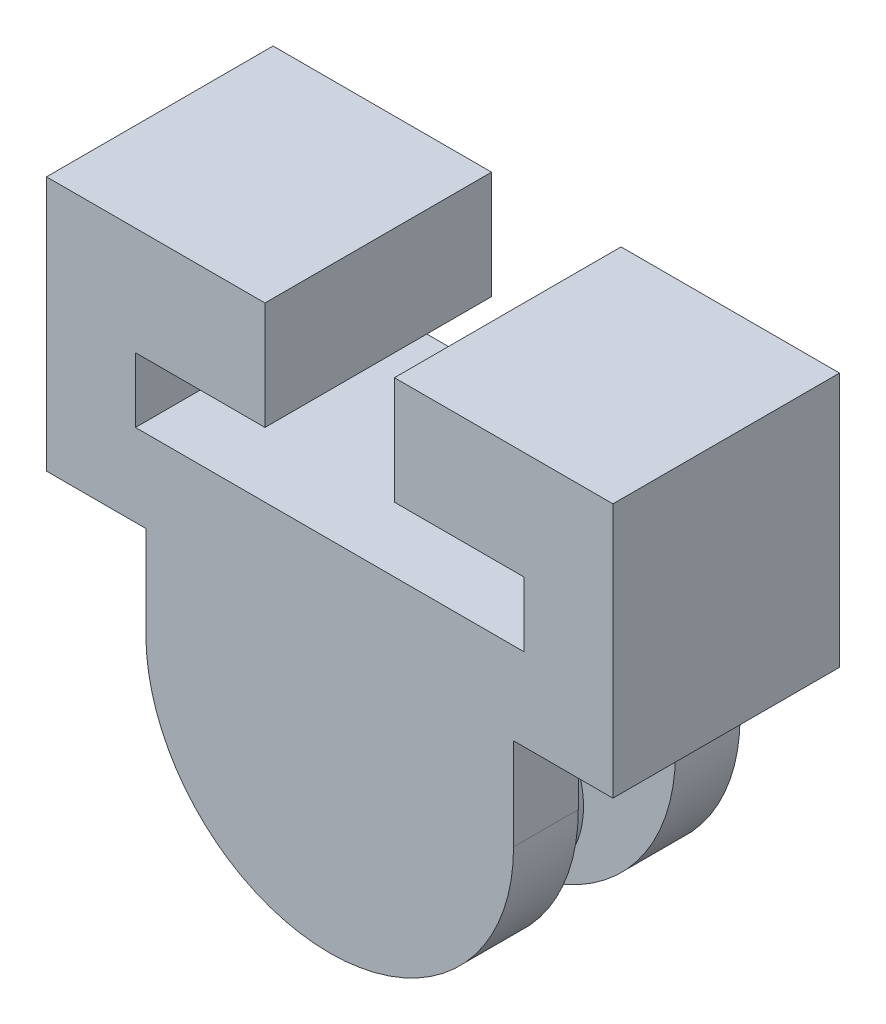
ISO-10303-21;
HEADER;
FILE_DESCRIPTION(('STEP AP214'),'2;1');
FILE_NAME('part.step','',(''),(''),'','','');
FILE_SCHEMA(('AUTOMOTIVE_DESIGN { 1 0 10303 214 1 1 1 1 }'));
ENDSEC;
DATA;
#1=APPLICATION_CONTEXT('core data for automotive mechanical design processes');
#2=APPLICATION_PROTOCOL_DEFINITION('international standard','automotive_design',2000,#1);
#3=PRODUCT_CONTEXT('',#1,'mechanical');
#4=PRODUCT('Part','Part','',(#3));
#5=PRODUCT_RELATED_PRODUCT_CATEGORY('part','',(#4));
#6=PRODUCT_DEFINITION_FORMATION('','',#4);
#7=PRODUCT_DEFINITION_CONTEXT('part definition',#1,'design');
#8=PRODUCT_DEFINITION('design','',#6,#7);
#9=PRODUCT_DEFINITION_SHAPE('','',#8);
#10=(LENGTH_UNIT() NAMED_UNIT(*) SI_UNIT(.MILLI.,.METRE.));
#11=(NAMED_UNIT(*) PLANE_ANGLE_UNIT() SI_UNIT($,.RADIAN.));
#12=(NAMED_UNIT(*) SI_UNIT($,.STERADIAN.) SOLID_ANGLE_UNIT());
#13=UNCERTAINTY_MEASURE_WITH_UNIT(LENGTH_MEASURE(1.E-05),#10,'distance_accuracy_value','');
#14=(GEOMETRIC_REPRESENTATION_CONTEXT(3) GLOBAL_UNCERTAINTY_ASSIGNED_CONTEXT((#13)) GLOBAL_UNIT_ASSIGNED_CONTEXT((#10,
#11,#12)) REPRESENTATION_CONTEXT('',''));
#15=CARTESIAN_POINT('',(0.,0.,0.));
#16=DIRECTION('',(0.,0.,1.));
#17=DIRECTION('',(1.,0.,0.));
#18=AXIS2_PLACEMENT_3D('',#15,#16,#17);
#19=CARTESIAN_POINT('',(-55.5625,70.2515647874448,144.042704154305));
#20=DIRECTION('',(0.,-1.,0.));
#21=DIRECTION('',(0.,0.,-1.));
#22=AXIS2_PLACEMENT_3D('',#19,#20,#21);
#23=PLANE('',#22);
#24=DIRECTION('',(0.,0.,-1.));
#25=VECTOR('',#24,1.);
#26=CARTESIAN_POINT('',(-38.1,70.2515647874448,53.3423344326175));
#27=LINE('',#26,#25);
#28=CARTESIAN_POINT('',(-38.1,70.2515647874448,44.45));
#29=VERTEX_POINT('',#28);
#30=CARTESIAN_POINT('',(-38.1,70.2515647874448,0.));
#31=VERTEX_POINT('',#30);
#32=EDGE_CURVE('E339',#29,#31,#27,.T.);
#33=ORIENTED_EDGE('',*,*,#32,.F.);
#34=DIRECTION('',(-1.,0.,0.));
#35=VECTOR('',#34,1.);
#36=CARTESIAN_POINT('',(38.1,70.2515647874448,44.45));
#37=LINE('',#36,#35);
#38=CARTESIAN_POINT('',(38.1,70.2515647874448,44.45));
#39=VERTEX_POINT('',#38);
#40=EDGE_CURVE('E267',#39,#29,#37,.T.);
#41=ORIENTED_EDGE('',*,*,#40,.F.);
#42=DIRECTION('',(0.,0.,-1.));
#43=VECTOR('',#42,1.);
#44=CARTESIAN_POINT('',(38.1,70.2515647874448,53.3423344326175));
#45=LINE('',#44,#43);
#46=CARTESIAN_POINT('',(38.1,70.2515647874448,0.));
#47=VERTEX_POINT('',#46);
#48=EDGE_CURVE('E334',#39,#47,#45,.T.);
#49=ORIENTED_EDGE('',*,*,#48,.T.);
#50=DIRECTION('',(-1.,0.,0.));
#51=VECTOR('',#50,1.);
#52=CARTESIAN_POINT('',(-55.5625,70.2515647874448,0.));
#53=LINE('',#52,#51);
#54=EDGE_CURVE('E353',#47,#31,#53,.T.);
#55=ORIENTED_EDGE('',*,*,#54,.T.);
#56=EDGE_LOOP('',(#33,#41,#49,#55));
#57=FACE_BOUND('',#56,.T.);
#58=ADVANCED_FACE('F47',(#57),#23,.F.);
#59=CARTESIAN_POINT('',(0.,36.0664038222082,12.7));
#60=DIRECTION('',(0.,0.,-1.));
#61=DIRECTION('',(-1.,0.,0.));
#62=AXIS2_PLACEMENT_3D('',#59,#60,#61);
#63=CYLINDRICAL_SURFACE('',#62,36.0664038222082);
#64=CARTESIAN_POINT('',(0.,36.0664038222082,0.));
#65=DIRECTION('',(0.,0.,1.));
#66=DIRECTION('',(-1.,0.,0.));
#67=AXIS2_PLACEMENT_3D('',#64,#65,#66);
#68=CIRCLE('',#67,36.0664038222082);
#69=CARTESIAN_POINT('',(-36.0664038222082,36.0664038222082,0.));
#70=VERTEX_POINT('',#69);
#71=CARTESIAN_POINT('',(36.0664038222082,36.0664038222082,0.));
#72=VERTEX_POINT('',#71);
#73=EDGE_CURVE('E381',#70,#72,#68,.T.);
#74=ORIENTED_EDGE('',*,*,#73,.T.);
#75=DIRECTION('',(0.,0.,-1.));
#76=VECTOR('',#75,1.);
#77=CARTESIAN_POINT('',(36.0664038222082,36.0664038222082,12.7));
#78=LINE('',#77,#76);
#79=CARTESIAN_POINT('',(36.0664038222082,36.0664038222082,12.7));
#80=VERTEX_POINT('',#79);
#81=EDGE_CURVE('E11',#80,#72,#78,.T.);
#82=ORIENTED_EDGE('',*,*,#81,.F.);
#83=CARTESIAN_POINT('',(0.,36.0664038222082,12.7));
#84=DIRECTION('',(0.,0.,1.));
#85=DIRECTION('',(-1.,0.,0.));
#86=AXIS2_PLACEMENT_3D('',#83,#84,#85);
#87=CIRCLE('',#86,36.0664038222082);
#88=CARTESIAN_POINT('',(0.,0.,12.7));
#89=VERTEX_POINT('',#88);
#90=EDGE_CURVE('E389',#89,#80,#87,.T.);
#91=ORIENTED_EDGE('',*,*,#90,.F.);
#92=CARTESIAN_POINT('',(-36.0664038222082,36.0664038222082,12.7));
#93=VERTEX_POINT('',#92);
#94=EDGE_CURVE('E385',#93,#89,#87,.T.);
#95=ORIENTED_EDGE('',*,*,#94,.F.);
#96=DIRECTION('',(0.,0.,-1.));
#97=VECTOR('',#96,1.);
#98=CARTESIAN_POINT('',(-36.0664038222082,36.0664038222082,12.7));
#99=LINE('',#98,#97);
#100=EDGE_CURVE('E398',#93,#70,#99,.T.);
#101=ORIENTED_EDGE('',*,*,#100,.T.);
#102=EDGE_LOOP('',(#74,#82,#91,#95,#101));
#103=FACE_BOUND('',#102,.T.);
#104=ADVANCED_FACE('F49',(#103),#63,.T.);
#105=CARTESIAN_POINT('',(36.0664038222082,36.0664038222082,12.7));
#106=DIRECTION('',(-1.,0.,0.));
#107=DIRECTION('',(0.,0.,1.));
#108=AXIS2_PLACEMENT_3D('',#105,#106,#107);
#109=PLANE('',#108);
#110=DIRECTION('',(0.,1.,0.));
#111=VECTOR('',#110,1.);
#112=CARTESIAN_POINT('',(36.0664038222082,36.0664038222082,0.));
#113=LINE('',#112,#111);
#114=CARTESIAN_POINT('',(36.0664038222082,54.0996057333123,0.));
#115=VERTEX_POINT('',#114);
#116=EDGE_CURVE('E402',#72,#115,#113,.T.);
#117=ORIENTED_EDGE('',*,*,#116,.T.);
#118=DIRECTION('',(0.,0.,-1.));
#119=VECTOR('',#118,1.);
#120=CARTESIAN_POINT('',(36.0664038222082,54.0996057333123,12.7));
#121=LINE('',#120,#119);
#122=CARTESIAN_POINT('',(36.0664038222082,54.0996057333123,12.7));
#123=VERTEX_POINT('',#122);
#124=EDGE_CURVE('E56',#123,#115,#121,.T.);
#125=ORIENTED_EDGE('',*,*,#124,.F.);
#126=DIRECTION('',(0.,1.,0.));
#127=VECTOR('',#126,1.);
#128=CARTESIAN_POINT('',(36.0664038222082,36.0664038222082,12.7));
#129=LINE('',#128,#127);
#130=EDGE_CURVE('E388',#80,#123,#129,.T.);
#131=ORIENTED_EDGE('',*,*,#130,.F.);
#132=ORIENTED_EDGE('',*,*,#81,.T.);
#133=EDGE_LOOP('',(#117,#125,#131,#132));
#134=FACE_BOUND('',#133,.T.);
#135=ADVANCED_FACE('F436',(#134),#109,.F.);
#136=CARTESIAN_POINT('',(-36.0664038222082,36.0664038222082,12.7));
#137=DIRECTION('',(1.,0.,0.));
#138=DIRECTION('',(0.,0.,-1.));
#139=AXIS2_PLACEMENT_3D('',#136,#137,#138);
#140=PLANE('',#139);
#141=DIRECTION('',(0.,-1.,0.));
#142=VECTOR('',#141,1.);
#143=CARTESIAN_POINT('',(-36.0664038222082,36.0664038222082,0.));
#144=LINE('',#143,#142);
#145=CARTESIAN_POINT('',(-36.0664038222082,54.0996057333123,0.));
#146=VERTEX_POINT('',#145);
#147=EDGE_CURVE('E405',#146,#70,#144,.T.);
#148=ORIENTED_EDGE('',*,*,#147,.T.);
#149=ORIENTED_EDGE('',*,*,#100,.F.);
#150=DIRECTION('',(0.,-1.,0.));
#151=VECTOR('',#150,1.);
#152=CARTESIAN_POINT('',(-36.0664038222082,36.0664038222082,12.7));
#153=LINE('',#152,#151);
#154=CARTESIAN_POINT('',(-36.0664038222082,54.0996057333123,12.7));
#155=VERTEX_POINT('',#154);
#156=EDGE_CURVE('E395',#155,#93,#153,.T.);
#157=ORIENTED_EDGE('',*,*,#156,.F.);
#158=DIRECTION('',(0.,0.,-1.));
#159=VECTOR('',#158,1.);
#160=CARTESIAN_POINT('',(-36.0664038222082,54.0996057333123,12.7));
#161=LINE('',#160,#159);
#162=EDGE_CURVE('E411',#155,#146,#161,.T.);
#163=ORIENTED_EDGE('',*,*,#162,.T.);
#164=EDGE_LOOP('',(#148,#149,#157,#163));
#165=FACE_BOUND('',#164,.T.);
#166=ADVANCED_FACE('F516',(#165),#140,.F.);
#167=CARTESIAN_POINT('',(0.,36.0664038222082,12.7));
#168=DIRECTION('',(0.,0.,-1.));
#169=DIRECTION('',(-1.,0.,0.));
#170=AXIS2_PLACEMENT_3D('',#167,#168,#169);
#171=PLANE('',#170);
#172=ORIENTED_EDGE('',*,*,#94,.T.);
#173=CARTESIAN_POINT('',(0.,18.0332019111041,12.7));
#174=DIRECTION('',(0.,0.,1.));
#175=DIRECTION('',(1.,0.,0.));
#176=AXIS2_PLACEMENT_3D('',#173,#174,#175);
#177=CIRCLE('',#176,18.0332019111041);
#178=EDGE_CURVE('E371',#89,#89,#177,.T.);
#179=ORIENTED_EDGE('',*,*,#178,.F.);
#180=ORIENTED_EDGE('',*,*,#90,.T.);
#181=ORIENTED_EDGE('',*,*,#130,.T.);
#182=DIRECTION('',(-1.,0.,0.));
#183=VECTOR('',#182,1.);
#184=CARTESIAN_POINT('',(-36.0664038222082,54.0996057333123,12.7));
#185=LINE('',#184,#183);
#186=EDGE_CURVE('E392',#123,#155,#185,.T.);
#187=ORIENTED_EDGE('',*,*,#186,.T.);
#188=ORIENTED_EDGE('',*,*,#156,.T.);
#189=EDGE_LOOP('',(#172,#179,#180,#181,#187,#188));
#190=FACE_BOUND('',#189,.T.);
#191=ADVANCED_FACE('F432',(#190),#171,.F.);
#192=CARTESIAN_POINT('',(0.,36.0664038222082,0.));
#193=DIRECTION('',(0.,0.,-1.));
#194=DIRECTION('',(-1.,0.,0.));
#195=AXIS2_PLACEMENT_3D('',#192,#193,#194);
#196=PLANE('',#195);
#197=ORIENTED_EDGE('',*,*,#73,.F.);
#198=ORIENTED_EDGE('',*,*,#147,.F.);
#199=DIRECTION('',(1.,0.,0.));
#200=VECTOR('',#199,1.);
#201=CARTESIAN_POINT('',(-55.5625,54.0996057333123,0.));
#202=LINE('',#201,#200);
#203=CARTESIAN_POINT('',(-55.5625,54.0996057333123,0.));
#204=VERTEX_POINT('',#203);
#205=EDGE_CURVE('E360',#204,#146,#202,.T.);
#206=ORIENTED_EDGE('',*,*,#205,.F.);
#207=DIRECTION('',(0.,-1.,0.));
#208=VECTOR('',#207,1.);
#209=CARTESIAN_POINT('',(-55.5625,54.0996057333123,0.));
#210=LINE('',#209,#208);
#211=CARTESIAN_POINT('',(-55.5625,104.105877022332,0.));
#212=VERTEX_POINT('',#211);
#213=EDGE_CURVE('E343',#212,#204,#210,.T.);
#214=ORIENTED_EDGE('',*,*,#213,.F.);
#215=DIRECTION('',(-1.,0.,0.));
#216=VECTOR('',#215,1.);
#217=CARTESIAN_POINT('',(-55.5625,104.105877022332,0.));
#218=LINE('',#217,#216);
#219=CARTESIAN_POINT('',(-12.7,104.105877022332,0.));
#220=VERTEX_POINT('',#219);
#221=EDGE_CURVE('E204',#220,#212,#218,.T.);
#222=ORIENTED_EDGE('',*,*,#221,.F.);
#223=DIRECTION('',(0.,1.,0.));
#224=VECTOR('',#223,1.);
#225=CARTESIAN_POINT('',(-12.7,82.9515647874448,0.));
#226=LINE('',#225,#224);
#227=CARTESIAN_POINT('',(-12.7,82.9515647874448,0.));
#228=VERTEX_POINT('',#227);
#229=EDGE_CURVE('E199',#228,#220,#226,.T.);
#230=ORIENTED_EDGE('',*,*,#229,.F.);
#231=DIRECTION('',(1.,0.,0.));
#232=VECTOR('',#231,1.);
#233=CARTESIAN_POINT('',(-55.5625,82.9515647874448,0.));
#234=LINE('',#233,#232);
#235=CARTESIAN_POINT('',(-38.1,82.9515647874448,0.));
#236=VERTEX_POINT('',#235);
#237=EDGE_CURVE('E320',#236,#228,#234,.T.);
#238=ORIENTED_EDGE('',*,*,#237,.F.);
#239=DIRECTION('',(0.,1.,0.));
#240=VECTOR('',#239,1.);
#241=CARTESIAN_POINT('',(-38.1,70.2515647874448,0.));
#242=LINE('',#241,#240);
#243=EDGE_CURVE('E346',#31,#236,#242,.T.);
#244=ORIENTED_EDGE('',*,*,#243,.F.);
#245=ORIENTED_EDGE('',*,*,#54,.F.);
#246=DIRECTION('',(0.,-1.,0.));
#247=VECTOR('',#246,1.);
#248=CARTESIAN_POINT('',(38.1,70.2515647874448,0.));
#249=LINE('',#248,#247);
#250=CARTESIAN_POINT('',(38.1,82.9515647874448,0.));
#251=VERTEX_POINT('',#250);
#252=EDGE_CURVE('E331',#251,#47,#249,.T.);
#253=ORIENTED_EDGE('',*,*,#252,.F.);
#254=DIRECTION('',(1.,0.,0.));
#255=VECTOR('',#254,1.);
#256=CARTESIAN_POINT('',(55.5625,82.9515647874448,0.));
#257=LINE('',#256,#255);
#258=CARTESIAN_POINT('',(12.7,82.9515647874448,0.));
#259=VERTEX_POINT('',#258);
#260=EDGE_CURVE('E297',#259,#251,#257,.T.);
#261=ORIENTED_EDGE('',*,*,#260,.F.);
#262=DIRECTION('',(0.,-1.,0.));
#263=VECTOR('',#262,1.);
#264=CARTESIAN_POINT('',(12.7,82.9515647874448,0.));
#265=LINE('',#264,#263);
#266=CARTESIAN_POINT('',(12.7,104.105877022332,0.));
#267=VERTEX_POINT('',#266);
#268=EDGE_CURVE('E302',#267,#259,#265,.T.);
#269=ORIENTED_EDGE('',*,*,#268,.F.);
#270=DIRECTION('',(-1.,0.,0.));
#271=VECTOR('',#270,1.);
#272=CARTESIAN_POINT('',(55.5625,104.105877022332,0.));
#273=LINE('',#272,#271);
#274=CARTESIAN_POINT('',(55.5625,104.105877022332,0.));
#275=VERTEX_POINT('',#274);
#276=EDGE_CURVE('E307',#275,#267,#273,.T.);
#277=ORIENTED_EDGE('',*,*,#276,.F.);
#278=DIRECTION('',(0.,1.,0.));
#279=VECTOR('',#278,1.);
#280=CARTESIAN_POINT('',(55.5625,54.0996057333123,0.));
#281=LINE('',#280,#279);
#282=CARTESIAN_POINT('',(55.5625,54.0996057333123,0.));
#283=VERTEX_POINT('',#282);
#284=EDGE_CURVE('E356',#283,#275,#281,.T.);
#285=ORIENTED_EDGE('',*,*,#284,.F.);
#286=EDGE_CURVE('E364',#115,#283,#202,.T.);
#287=ORIENTED_EDGE('',*,*,#286,.F.);
#288=ORIENTED_EDGE('',*,*,#116,.F.);
#289=EDGE_LOOP('',(#197,#198,#206,#214,#222,#230,#238,#244,#245,#253,#261,#269,#277,#285,#287,#288));
#290=FACE_BOUND('',#289,.T.);
#291=ADVANCED_FACE('F425',(#290),#196,.T.);
#292=CARTESIAN_POINT('',(0.,18.0332019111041,31.75));
#293=DIRECTION('',(0.,0.,-1.));
#294=DIRECTION('',(-1.,0.,0.));
#295=AXIS2_PLACEMENT_3D('',#292,#293,#294);
#296=CYLINDRICAL_SURFACE('',#295,18.0332019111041);
#297=CARTESIAN_POINT('',(0.,18.0332019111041,31.75));
#298=DIRECTION('',(0.,0.,1.));
#299=DIRECTION('',(1.,0.,0.));
#300=AXIS2_PLACEMENT_3D('',#297,#298,#299);
#301=CIRCLE('',#300,18.0332019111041);
#302=CARTESIAN_POINT('',(0.,0.,31.75));
#303=VERTEX_POINT('',#302);
#304=EDGE_CURVE('E377',#303,#303,#301,.T.);
#305=ORIENTED_EDGE('',*,*,#304,.F.);
#306=EDGE_LOOP('',(#305));
#307=FACE_BOUND('',#306,.T.);
#308=ORIENTED_EDGE('',*,*,#178,.T.);
#309=EDGE_LOOP('',(#308));
#310=FACE_BOUND('',#309,.T.);
#311=ADVANCED_FACE('F511',(#307,#310),#296,.T.);
#312=CARTESIAN_POINT('',(-55.5625,54.0996057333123,144.042704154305));
#313=DIRECTION('',(1.,0.,0.));
#314=DIRECTION('',(0.,0.,-1.));
#315=AXIS2_PLACEMENT_3D('',#312,#313,#314);
#316=PLANE('',#315);
#317=DIRECTION('',(0.,0.,-1.));
#318=VECTOR('',#317,1.);
#319=CARTESIAN_POINT('',(-55.5625,54.0996057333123,144.042704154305));
#320=LINE('',#319,#318);
#321=CARTESIAN_POINT('',(-55.5625,54.0996057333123,44.45));
#322=VERTEX_POINT('',#321);
#323=EDGE_CURVE('E368',#322,#204,#320,.T.);
#324=ORIENTED_EDGE('',*,*,#323,.F.);
#325=DIRECTION('',(0.,-1.,0.));
#326=VECTOR('',#325,1.);
#327=CARTESIAN_POINT('',(-55.5625,104.105877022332,44.45));
#328=LINE('',#327,#326);
#329=CARTESIAN_POINT('',(-55.5625,104.105877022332,44.45));
#330=VERTEX_POINT('',#329);
#331=EDGE_CURVE('E215',#330,#322,#328,.T.);
#332=ORIENTED_EDGE('',*,*,#331,.F.);
#333=DIRECTION('',(0.,0.,-1.));
#334=VECTOR('',#333,1.);
#335=CARTESIAN_POINT('',(-55.5625,104.105877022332,79.5485233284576));
#336=LINE('',#335,#334);
#337=EDGE_CURVE('E210',#330,#212,#336,.T.);
#338=ORIENTED_EDGE('',*,*,#337,.T.);
#339=ORIENTED_EDGE('',*,*,#213,.T.);
#340=EDGE_LOOP('',(#324,#332,#338,#339));
#341=FACE_BOUND('',#340,.T.);
#342=ADVANCED_FACE('F443',(#341),#316,.F.);
#343=CARTESIAN_POINT('',(-55.5625,54.0996057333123,144.042704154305));
#344=DIRECTION('',(0.,1.,0.));
#345=DIRECTION('',(0.,0.,1.));
#346=AXIS2_PLACEMENT_3D('',#343,#344,#345);
#347=PLANE('',#346);
#348=ORIENTED_EDGE('',*,*,#162,.F.);
#349=ORIENTED_EDGE('',*,*,#186,.F.);
#350=ORIENTED_EDGE('',*,*,#124,.T.);
#351=ORIENTED_EDGE('',*,*,#286,.T.);
#352=DIRECTION('',(0.,0.,-1.));
#353=VECTOR('',#352,1.);
#354=CARTESIAN_POINT('',(55.5625,54.0996057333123,144.042704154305));
#355=LINE('',#354,#353);
#356=CARTESIAN_POINT('',(55.5625,54.0996057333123,44.45));
#357=VERTEX_POINT('',#356);
#358=EDGE_CURVE('E359',#357,#283,#355,.T.);
#359=ORIENTED_EDGE('',*,*,#358,.F.);
#360=DIRECTION('',(1.,0.,0.));
#361=VECTOR('',#360,1.);
#362=CARTESIAN_POINT('',(36.0664038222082,54.0996057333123,44.45));
#363=LINE('',#362,#361);
#364=CARTESIAN_POINT('',(36.0664038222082,54.0996057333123,44.45));
#365=VERTEX_POINT('',#364);
#366=EDGE_CURVE('E243',#365,#357,#363,.T.);
#367=ORIENTED_EDGE('',*,*,#366,.F.);
#368=DIRECTION('',(0.,0.,-1.));
#369=VECTOR('',#368,1.);
#370=CARTESIAN_POINT('',(36.0664038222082,54.0996057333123,44.45));
#371=LINE('',#370,#369);
#372=CARTESIAN_POINT('',(36.0664038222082,54.0996057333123,31.75));
#373=VERTEX_POINT('',#372);
#374=EDGE_CURVE('E276',#365,#373,#371,.T.);
#375=ORIENTED_EDGE('',*,*,#374,.T.);
#376=DIRECTION('',(1.,0.,0.));
#377=VECTOR('',#376,1.);
#378=CARTESIAN_POINT('',(-55.5625,54.0996057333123,31.75));
#379=LINE('',#378,#377);
#380=CARTESIAN_POINT('',(-36.0664038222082,54.0996057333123,31.75));
#381=VERTEX_POINT('',#380);
#382=EDGE_CURVE('E63',#381,#373,#379,.T.);
#383=ORIENTED_EDGE('',*,*,#382,.F.);
#384=DIRECTION('',(0.,0.,-1.));
#385=VECTOR('',#384,1.);
#386=CARTESIAN_POINT('',(-36.0664038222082,54.0996057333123,44.45));
#387=LINE('',#386,#385);
#388=CARTESIAN_POINT('',(-36.0664038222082,54.0996057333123,44.45));
#389=VERTEX_POINT('',#388);
#390=EDGE_CURVE('E294',#389,#381,#387,.T.);
#391=ORIENTED_EDGE('',*,*,#390,.F.);
#392=DIRECTION('',(1.,0.,0.));
#393=VECTOR('',#392,1.);
#394=CARTESIAN_POINT('',(-55.5625,54.0996057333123,44.45));
#395=LINE('',#394,#393);
#396=EDGE_CURVE('E231',#322,#389,#395,.T.);
#397=ORIENTED_EDGE('',*,*,#396,.F.);
#398=ORIENTED_EDGE('',*,*,#323,.T.);
#399=ORIENTED_EDGE('',*,*,#205,.T.);
#400=EDGE_LOOP('',(#348,#349,#350,#351,#359,#367,#375,#383,#391,#397,#398,#399));
#401=FACE_BOUND('',#400,.T.);
#402=ADVANCED_FACE('F419',(#401),#347,.F.);
#403=CARTESIAN_POINT('',(55.5625,54.0996057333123,144.042704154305));
#404=DIRECTION('',(-1.,0.,0.));
#405=DIRECTION('',(0.,0.,1.));
#406=AXIS2_PLACEMENT_3D('',#403,#404,#405);
#407=PLANE('',#406);
#408=DIRECTION('',(0.,0.,-1.));
#409=VECTOR('',#408,1.);
#410=CARTESIAN_POINT('',(55.5625,104.105877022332,79.5485233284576));
#411=LINE('',#410,#409);
#412=CARTESIAN_POINT('',(55.5625,104.105877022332,44.45));
#413=VERTEX_POINT('',#412);
#414=EDGE_CURVE('E311',#413,#275,#411,.T.);
#415=ORIENTED_EDGE('',*,*,#414,.F.);
#416=DIRECTION('',(0.,1.,0.));
#417=VECTOR('',#416,1.);
#418=CARTESIAN_POINT('',(55.5625,54.0996057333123,44.45));
#419=LINE('',#418,#417);
#420=EDGE_CURVE('E247',#357,#413,#419,.T.);
#421=ORIENTED_EDGE('',*,*,#420,.F.);
#422=ORIENTED_EDGE('',*,*,#358,.T.);
#423=ORIENTED_EDGE('',*,*,#284,.T.);
#424=EDGE_LOOP('',(#415,#421,#422,#423));
#425=FACE_BOUND('',#424,.T.);
#426=ADVANCED_FACE('F460',(#425),#407,.F.);
#427=CARTESIAN_POINT('',(-38.1,70.2515647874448,53.3423344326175));
#428=DIRECTION('',(-1.,0.,0.));
#429=DIRECTION('',(0.,0.,1.));
#430=AXIS2_PLACEMENT_3D('',#427,#428,#429);
#431=PLANE('',#430);
#432=DIRECTION('',(0.,0.,-1.));
#433=VECTOR('',#432,1.);
#434=CARTESIAN_POINT('',(-38.1,82.9515647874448,53.3423344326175));
#435=LINE('',#434,#433);
#436=CARTESIAN_POINT('',(-38.1,82.9515647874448,44.45));
#437=VERTEX_POINT('',#436);
#438=EDGE_CURVE('E300',#437,#236,#435,.T.);
#439=ORIENTED_EDGE('',*,*,#438,.F.);
#440=DIRECTION('',(0.,1.,0.));
#441=VECTOR('',#440,1.);
#442=CARTESIAN_POINT('',(-38.1,70.2515647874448,44.45));
#443=LINE('',#442,#441);
#444=EDGE_CURVE('E271',#29,#437,#443,.T.);
#445=ORIENTED_EDGE('',*,*,#444,.F.);
#446=ORIENTED_EDGE('',*,*,#32,.T.);
#447=ORIENTED_EDGE('',*,*,#243,.T.);
#448=EDGE_LOOP('',(#439,#445,#446,#447));
#449=FACE_BOUND('',#448,.T.);
#450=ADVANCED_FACE('F483',(#449),#431,.F.);
#451=CARTESIAN_POINT('',(38.1,70.2515647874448,53.3423344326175));
#452=DIRECTION('',(1.,0.,0.));
#453=DIRECTION('',(0.,0.,-1.));
#454=AXIS2_PLACEMENT_3D('',#451,#452,#453);
#455=PLANE('',#454);
#456=ORIENTED_EDGE('',*,*,#48,.F.);
#457=DIRECTION('',(0.,-1.,0.));
#458=VECTOR('',#457,1.);
#459=CARTESIAN_POINT('',(38.1,82.9515647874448,44.45));
#460=LINE('',#459,#458);
#461=CARTESIAN_POINT('',(38.1,82.9515647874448,44.45));
#462=VERTEX_POINT('',#461);
#463=EDGE_CURVE('E263',#462,#39,#460,.T.);
#464=ORIENTED_EDGE('',*,*,#463,.F.);
#465=DIRECTION('',(0.,0.,-1.));
#466=VECTOR('',#465,1.);
#467=CARTESIAN_POINT('',(38.1,82.9515647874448,53.3423344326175));
#468=LINE('',#467,#466);
#469=EDGE_CURVE('E335',#462,#251,#468,.T.);
#470=ORIENTED_EDGE('',*,*,#469,.T.);
#471=ORIENTED_EDGE('',*,*,#252,.T.);
#472=EDGE_LOOP('',(#456,#464,#470,#471));
#473=FACE_BOUND('',#472,.T.);
#474=ADVANCED_FACE('F475',(#473),#455,.F.);
#475=CARTESIAN_POINT('',(55.5625,82.9515647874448,79.5485233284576));
#476=DIRECTION('',(0.,1.,0.));
#477=DIRECTION('',(0.,0.,1.));
#478=AXIS2_PLACEMENT_3D('',#475,#476,#477);
#479=PLANE('',#478);
#480=ORIENTED_EDGE('',*,*,#260,.T.);
#481=ORIENTED_EDGE('',*,*,#469,.F.);
#482=DIRECTION('',(1.,0.,0.));
#483=VECTOR('',#482,1.);
#484=CARTESIAN_POINT('',(12.7,82.9515647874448,44.45));
#485=LINE('',#484,#483);
#486=CARTESIAN_POINT('',(12.7,82.9515647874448,44.45));
#487=VERTEX_POINT('',#486);
#488=EDGE_CURVE('E259',#487,#462,#485,.T.);
#489=ORIENTED_EDGE('',*,*,#488,.F.);
#490=DIRECTION('',(0.,0.,-1.));
#491=VECTOR('',#490,1.);
#492=CARTESIAN_POINT('',(12.7,82.9515647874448,79.5485233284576));
#493=LINE('',#492,#491);
#494=EDGE_CURVE('E301',#487,#259,#493,.T.);
#495=ORIENTED_EDGE('',*,*,#494,.T.);
#496=EDGE_LOOP('',(#480,#481,#489,#495));
#497=FACE_BOUND('',#496,.T.);
#498=ADVANCED_FACE('F472',(#497),#479,.F.);
#499=CARTESIAN_POINT('',(55.5625,104.105877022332,79.5485233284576));
#500=DIRECTION('',(0.,-1.,0.));
#501=DIRECTION('',(0.,0.,-1.));
#502=AXIS2_PLACEMENT_3D('',#499,#500,#501);
#503=PLANE('',#502);
#504=DIRECTION('',(0.,0.,-1.));
#505=VECTOR('',#504,1.);
#506=CARTESIAN_POINT('',(12.7,104.105877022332,79.5485233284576));
#507=LINE('',#506,#505);
#508=CARTESIAN_POINT('',(12.7,104.105877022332,44.45));
#509=VERTEX_POINT('',#508);
#510=EDGE_CURVE('E306',#509,#267,#507,.T.);
#511=ORIENTED_EDGE('',*,*,#510,.F.);
#512=DIRECTION('',(-1.,0.,0.));
#513=VECTOR('',#512,1.);
#514=CARTESIAN_POINT('',(55.5625,104.105877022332,44.45));
#515=LINE('',#514,#513);
#516=EDGE_CURVE('E251',#413,#509,#515,.T.);
#517=ORIENTED_EDGE('',*,*,#516,.F.);
#518=ORIENTED_EDGE('',*,*,#414,.T.);
#519=ORIENTED_EDGE('',*,*,#276,.T.);
#520=EDGE_LOOP('',(#511,#517,#518,#519));
#521=FACE_BOUND('',#520,.T.);
#522=ADVANCED_FACE('F464',(#521),#503,.F.);
#523=CARTESIAN_POINT('',(12.7,82.9515647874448,79.5485233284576));
#524=DIRECTION('',(1.,0.,0.));
#525=DIRECTION('',(0.,0.,-1.));
#526=AXIS2_PLACEMENT_3D('',#523,#524,#525);
#527=PLANE('',#526);
#528=ORIENTED_EDGE('',*,*,#494,.F.);
#529=DIRECTION('',(0.,-1.,0.));
#530=VECTOR('',#529,1.);
#531=CARTESIAN_POINT('',(12.7,104.105877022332,44.45));
#532=LINE('',#531,#530);
#533=EDGE_CURVE('E255',#509,#487,#532,.T.);
#534=ORIENTED_EDGE('',*,*,#533,.F.);
#535=ORIENTED_EDGE('',*,*,#510,.T.);
#536=ORIENTED_EDGE('',*,*,#268,.T.);
#537=EDGE_LOOP('',(#528,#534,#535,#536));
#538=FACE_BOUND('',#537,.T.);
#539=ADVANCED_FACE('F467',(#538),#527,.F.);
#540=CARTESIAN_POINT('',(-55.5625,82.9515647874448,79.5485233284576));
#541=DIRECTION('',(0.,1.,0.));
#542=DIRECTION('',(0.,0.,1.));
#543=AXIS2_PLACEMENT_3D('',#540,#541,#542);
#544=PLANE('',#543);
#545=DIRECTION('',(0.,0.,-1.));
#546=VECTOR('',#545,1.);
#547=CARTESIAN_POINT('',(-12.7,82.9515647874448,79.5485233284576));
#548=LINE('',#547,#546);
#549=CARTESIAN_POINT('',(-12.7,82.9515647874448,44.45));
#550=VERTEX_POINT('',#549);
#551=EDGE_CURVE('E322',#550,#228,#548,.T.);
#552=ORIENTED_EDGE('',*,*,#551,.F.);
#553=DIRECTION('',(1.,0.,0.));
#554=VECTOR('',#553,1.);
#555=CARTESIAN_POINT('',(-38.1,82.9515647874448,44.45));
#556=LINE('',#555,#554);
#557=EDGE_CURVE('E221',#437,#550,#556,.T.);
#558=ORIENTED_EDGE('',*,*,#557,.F.);
#559=ORIENTED_EDGE('',*,*,#438,.T.);
#560=ORIENTED_EDGE('',*,*,#237,.T.);
#561=EDGE_LOOP('',(#552,#558,#559,#560));
#562=FACE_BOUND('',#561,.T.);
#563=ADVANCED_FACE('F485',(#562),#544,.F.);
#564=CARTESIAN_POINT('',(-12.7,82.9515647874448,79.5485233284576));
#565=DIRECTION('',(-1.,0.,0.));
#566=DIRECTION('',(0.,0.,1.));
#567=AXIS2_PLACEMENT_3D('',#564,#565,#566);
#568=PLANE('',#567);
#569=DIRECTION('',(0.,0.,-1.));
#570=VECTOR('',#569,1.);
#571=CARTESIAN_POINT('',(-12.7,104.105877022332,79.5485233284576));
#572=LINE('',#571,#570);
#573=CARTESIAN_POINT('',(-12.7,104.105877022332,44.45));
#574=VERTEX_POINT('',#573);
#575=EDGE_CURVE('E192',#574,#220,#572,.T.);
#576=ORIENTED_EDGE('',*,*,#575,.F.);
#577=DIRECTION('',(0.,1.,0.));
#578=VECTOR('',#577,1.);
#579=CARTESIAN_POINT('',(-12.7,82.9515647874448,44.45));
#580=LINE('',#579,#578);
#581=EDGE_CURVE('E197',#550,#574,#580,.T.);
#582=ORIENTED_EDGE('',*,*,#581,.F.);
#583=ORIENTED_EDGE('',*,*,#551,.T.);
#584=ORIENTED_EDGE('',*,*,#229,.T.);
#585=EDGE_LOOP('',(#576,#582,#583,#584));
#586=FACE_BOUND('',#585,.T.);
#587=ADVANCED_FACE('F194',(#586),#568,.F.);
#588=CARTESIAN_POINT('',(-55.5625,104.105877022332,79.5485233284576));
#589=DIRECTION('',(0.,-1.,0.));
#590=DIRECTION('',(0.,0.,-1.));
#591=AXIS2_PLACEMENT_3D('',#588,#589,#590);
#592=PLANE('',#591);
#593=ORIENTED_EDGE('',*,*,#337,.F.);
#594=DIRECTION('',(-1.,0.,0.));
#595=VECTOR('',#594,1.);
#596=CARTESIAN_POINT('',(-12.7,104.105877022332,44.45));
#597=LINE('',#596,#595);
#598=EDGE_CURVE('E207',#574,#330,#597,.T.);
#599=ORIENTED_EDGE('',*,*,#598,.F.);
#600=ORIENTED_EDGE('',*,*,#575,.T.);
#601=ORIENTED_EDGE('',*,*,#221,.T.);
#602=EDGE_LOOP('',(#593,#599,#600,#601));
#603=FACE_BOUND('',#602,.T.);
#604=ADVANCED_FACE('F208',(#603),#592,.F.);
#605=CARTESIAN_POINT('',(0.,36.0664038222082,31.75));
#606=DIRECTION('',(0.,0.,1.));
#607=DIRECTION('',(1.,0.,0.));
#608=AXIS2_PLACEMENT_3D('',#605,#606,#607);
#609=PLANE('',#608);
#610=CARTESIAN_POINT('',(0.,36.0664038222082,31.75));
#611=DIRECTION('',(0.,0.,1.));
#612=DIRECTION('',(1.,0.,0.));
#613=AXIS2_PLACEMENT_3D('',#610,#611,#612);
#614=CIRCLE('',#613,36.0664038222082);
#615=CARTESIAN_POINT('',(36.0664038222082,36.0664038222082,31.75));
#616=VERTEX_POINT('',#615);
#617=EDGE_CURVE('E280',#303,#616,#614,.T.);
#618=ORIENTED_EDGE('',*,*,#617,.F.);
#619=ORIENTED_EDGE('',*,*,#304,.T.);
#620=CARTESIAN_POINT('',(-36.0664038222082,36.0664038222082,31.75));
#621=VERTEX_POINT('',#620);
#622=EDGE_CURVE('E226',#621,#303,#614,.T.);
#623=ORIENTED_EDGE('',*,*,#622,.F.);
#624=DIRECTION('',(0.,-1.,0.));
#625=VECTOR('',#624,1.);
#626=CARTESIAN_POINT('',(-36.0664038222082,36.0664038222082,31.75));
#627=LINE('',#626,#625);
#628=EDGE_CURVE('E277',#381,#621,#627,.T.);
#629=ORIENTED_EDGE('',*,*,#628,.F.);
#630=ORIENTED_EDGE('',*,*,#382,.T.);
#631=DIRECTION('',(0.,1.,0.));
#632=VECTOR('',#631,1.);
#633=CARTESIAN_POINT('',(36.0664038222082,36.0664038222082,31.75));
#634=LINE('',#633,#632);
#635=EDGE_CURVE('E223',#616,#373,#634,.T.);
#636=ORIENTED_EDGE('',*,*,#635,.F.);
#637=EDGE_LOOP('',(#618,#619,#623,#629,#630,#636));
#638=FACE_BOUND('',#637,.T.);
#639=ADVANCED_FACE('F621',(#638),#609,.F.);
#640=CARTESIAN_POINT('',(-36.0664038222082,36.0664038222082,44.45));
#641=DIRECTION('',(1.,0.,0.));
#642=DIRECTION('',(0.,0.,-1.));
#643=AXIS2_PLACEMENT_3D('',#640,#641,#642);
#644=PLANE('',#643);
#645=ORIENTED_EDGE('',*,*,#628,.T.);
#646=DIRECTION('',(0.,0.,-1.));
#647=VECTOR('',#646,1.);
#648=CARTESIAN_POINT('',(-36.0664038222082,36.0664038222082,44.45));
#649=LINE('',#648,#647);
#650=CARTESIAN_POINT('',(-36.0664038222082,36.0664038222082,44.45));
#651=VERTEX_POINT('',#650);
#652=EDGE_CURVE('E290',#651,#621,#649,.T.);
#653=ORIENTED_EDGE('',*,*,#652,.F.);
#654=DIRECTION('',(0.,-1.,0.));
#655=VECTOR('',#654,1.);
#656=CARTESIAN_POINT('',(-36.0664038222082,36.0664038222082,44.45));
#657=LINE('',#656,#655);
#658=EDGE_CURVE('E234',#389,#651,#657,.T.);
#659=ORIENTED_EDGE('',*,*,#658,.F.);
#660=ORIENTED_EDGE('',*,*,#390,.T.);
#661=EDGE_LOOP('',(#645,#653,#659,#660));
#662=FACE_BOUND('',#661,.T.);
#663=ADVANCED_FACE('F447',(#662),#644,.F.);
#664=CARTESIAN_POINT('',(0.,36.0664038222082,44.45));
#665=DIRECTION('',(0.,0.,-1.));
#666=DIRECTION('',(-1.,0.,0.));
#667=AXIS2_PLACEMENT_3D('',#664,#665,#666);
#668=CYLINDRICAL_SURFACE('',#667,36.0664038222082);
#669=ORIENTED_EDGE('',*,*,#622,.T.);
#670=ORIENTED_EDGE('',*,*,#617,.T.);
#671=DIRECTION('',(0.,0.,-1.));
#672=VECTOR('',#671,1.);
#673=CARTESIAN_POINT('',(36.0664038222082,36.0664038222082,44.45));
#674=LINE('',#673,#672);
#675=CARTESIAN_POINT('',(36.0664038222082,36.0664038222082,44.45));
#676=VERTEX_POINT('',#675);
#677=EDGE_CURVE('E286',#676,#616,#674,.T.);
#678=ORIENTED_EDGE('',*,*,#677,.F.);
#679=CARTESIAN_POINT('',(0.,36.0664038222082,44.45));
#680=DIRECTION('',(0.,0.,1.));
#681=DIRECTION('',(1.,0.,0.));
#682=AXIS2_PLACEMENT_3D('',#679,#680,#681);
#683=CIRCLE('',#682,36.0664038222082);
#684=EDGE_CURVE('E237',#651,#676,#683,.T.);
#685=ORIENTED_EDGE('',*,*,#684,.F.);
#686=ORIENTED_EDGE('',*,*,#652,.T.);
#687=EDGE_LOOP('',(#669,#670,#678,#685,#686));
#688=FACE_BOUND('',#687,.T.);
#689=ADVANCED_FACE('F452',(#688),#668,.T.);
#690=CARTESIAN_POINT('',(36.0664038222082,36.0664038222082,44.45));
#691=DIRECTION('',(-1.,0.,0.));
#692=DIRECTION('',(0.,0.,1.));
#693=AXIS2_PLACEMENT_3D('',#690,#691,#692);
#694=PLANE('',#693);
#695=ORIENTED_EDGE('',*,*,#635,.T.);
#696=ORIENTED_EDGE('',*,*,#374,.F.);
#697=DIRECTION('',(0.,1.,0.));
#698=VECTOR('',#697,1.);
#699=CARTESIAN_POINT('',(36.0664038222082,36.0664038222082,44.45));
#700=LINE('',#699,#698);
#701=EDGE_CURVE('E240',#676,#365,#700,.T.);
#702=ORIENTED_EDGE('',*,*,#701,.F.);
#703=ORIENTED_EDGE('',*,*,#677,.T.);
#704=EDGE_LOOP('',(#695,#696,#702,#703));
#705=FACE_BOUND('',#704,.T.);
#706=ADVANCED_FACE('F458',(#705),#694,.F.);
#707=CARTESIAN_POINT('',(0.,36.0664038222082,44.45));
#708=DIRECTION('',(0.,0.,1.));
#709=DIRECTION('',(1.,0.,0.));
#710=AXIS2_PLACEMENT_3D('',#707,#708,#709);
#711=PLANE('',#710);
#712=ORIENTED_EDGE('',*,*,#581,.T.);
#713=ORIENTED_EDGE('',*,*,#598,.T.);
#714=ORIENTED_EDGE('',*,*,#331,.T.);
#715=ORIENTED_EDGE('',*,*,#396,.T.);
#716=ORIENTED_EDGE('',*,*,#658,.T.);
#717=ORIENTED_EDGE('',*,*,#684,.T.);
#718=ORIENTED_EDGE('',*,*,#701,.T.);
#719=ORIENTED_EDGE('',*,*,#366,.T.);
#720=ORIENTED_EDGE('',*,*,#420,.T.);
#721=ORIENTED_EDGE('',*,*,#516,.T.);
#722=ORIENTED_EDGE('',*,*,#533,.T.);
#723=ORIENTED_EDGE('',*,*,#488,.T.);
#724=ORIENTED_EDGE('',*,*,#463,.T.);
#725=ORIENTED_EDGE('',*,*,#40,.T.);
#726=ORIENTED_EDGE('',*,*,#444,.T.);
#727=ORIENTED_EDGE('',*,*,#557,.T.);
#728=EDGE_LOOP('',(#712,#713,#714,#715,#716,#717,#718,#719,#720,#721,#722,#723,#724,#725,#726,#727));
#729=FACE_BOUND('',#728,.T.);
#730=ADVANCED_FACE('F218',(#729),#711,.T.);
#731=CLOSED_SHELL('',(#58,#104,#135,#166,#191,#291,#311,#342,#402,#426,#450,#474,#498,#522,#539,
#563,#587,#604,#639,#663,#689,#706,#730));
#732=MANIFOLD_SOLID_BREP('B2',#731);
#733=ADVANCED_BREP_SHAPE_REPRESENTATION('',(#18,#732),#14);
#734=SHAPE_DEFINITION_REPRESENTATION(#9,#733);
ENDSEC;
END-ISO-10303-21;
